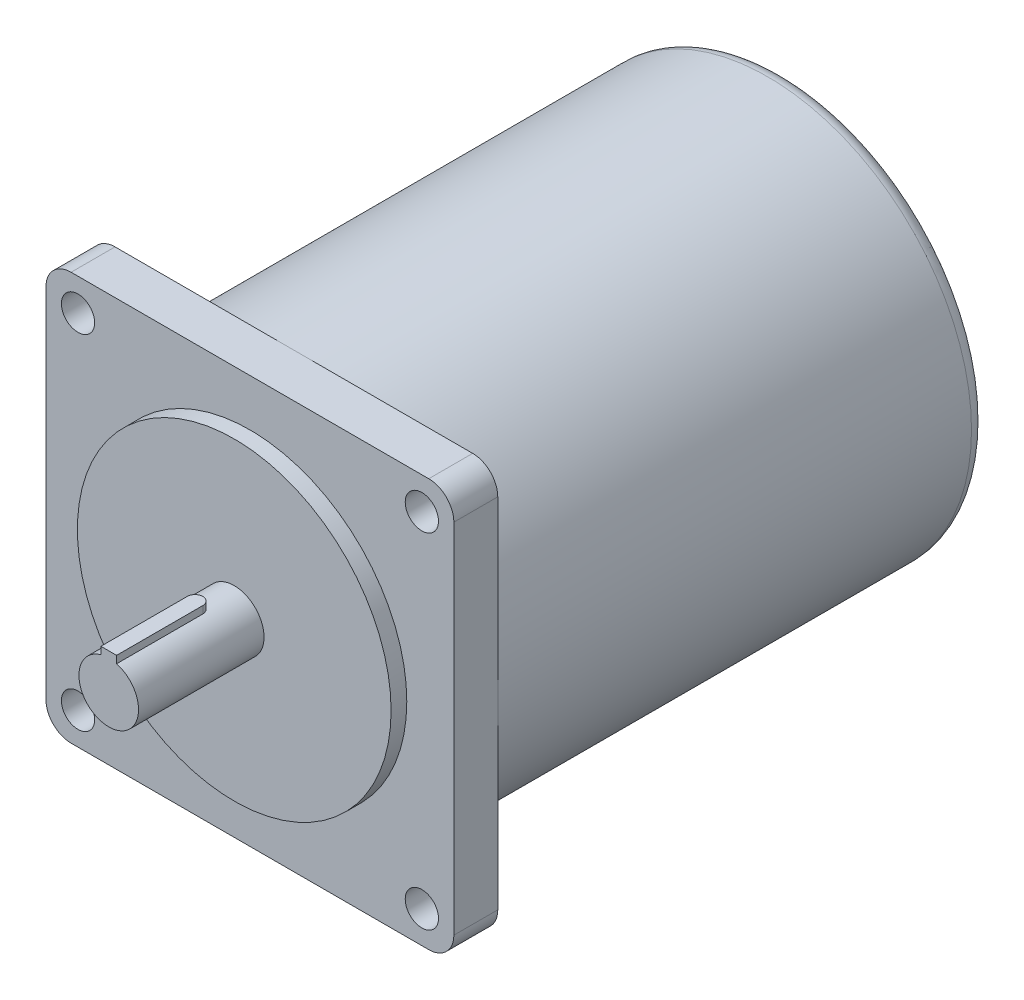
ISO-10303-21;
HEADER;
FILE_DESCRIPTION(('STEP AP214'),'2;1');
FILE_NAME('part.step','',(''),(''),'','','');
FILE_SCHEMA(('AUTOMOTIVE_DESIGN { 1 0 10303 214 1 1 1 1 }'));
ENDSEC;
DATA;
#1=APPLICATION_CONTEXT('core data for automotive mechanical design processes');
#2=APPLICATION_PROTOCOL_DEFINITION('international standard','automotive_design',2000,#1);
#3=PRODUCT_CONTEXT('',#1,'mechanical');
#4=PRODUCT('Part','Part','',(#3));
#5=PRODUCT_RELATED_PRODUCT_CATEGORY('part','',(#4));
#6=PRODUCT_DEFINITION_FORMATION('','',#4);
#7=PRODUCT_DEFINITION_CONTEXT('part definition',#1,'design');
#8=PRODUCT_DEFINITION('design','',#6,#7);
#9=PRODUCT_DEFINITION_SHAPE('','',#8);
#10=(LENGTH_UNIT() NAMED_UNIT(*) SI_UNIT(.MILLI.,.METRE.));
#11=(NAMED_UNIT(*) PLANE_ANGLE_UNIT() SI_UNIT($,.RADIAN.));
#12=(NAMED_UNIT(*) SI_UNIT($,.STERADIAN.) SOLID_ANGLE_UNIT());
#13=UNCERTAINTY_MEASURE_WITH_UNIT(LENGTH_MEASURE(1.E-05),#10,'distance_accuracy_value','');
#14=(GEOMETRIC_REPRESENTATION_CONTEXT(3) GLOBAL_UNCERTAINTY_ASSIGNED_CONTEXT((#13)) GLOBAL_UNIT_ASSIGNED_CONTEXT((#10,
#11,#12)) REPRESENTATION_CONTEXT('',''));
#15=CARTESIAN_POINT('',(0.,0.,0.));
#16=DIRECTION('',(0.,0.,1.));
#17=DIRECTION('',(1.,0.,0.));
#18=AXIS2_PLACEMENT_3D('',#15,#16,#17);
#19=CARTESIAN_POINT('',(57.,-57.,-19.));
#20=DIRECTION('',(0.,0.,1.));
#21=DIRECTION('',(1.,0.,0.));
#22=AXIS2_PLACEMENT_3D('',#19,#20,#21);
#23=PLANE('',#22);
#24=CARTESIAN_POINT('',(-54.8,54.8,-19.));
#25=DIRECTION('',(0.,0.,-1.));
#26=DIRECTION('',(-1.,0.,0.));
#27=AXIS2_PLACEMENT_3D('',#24,#25,#26);
#28=CIRCLE('',#27,5.3);
#29=CARTESIAN_POINT('',(-60.1,54.8,-19.));
#30=VERTEX_POINT('',#29);
#31=EDGE_CURVE('E184',#30,#30,#28,.T.);
#32=ORIENTED_EDGE('',*,*,#31,.F.);
#33=EDGE_LOOP('',(#32));
#34=FACE_BOUND('',#33,.T.);
#35=CARTESIAN_POINT('',(0.,0.,-19.));
#36=DIRECTION('',(0.,0.,-1.));
#37=DIRECTION('',(-1.,0.,0.));
#38=AXIS2_PLACEMENT_3D('',#35,#36,#37);
#39=CIRCLE('',#38,65.);
#40=CARTESIAN_POINT('',(-65.,0.,-19.));
#41=VERTEX_POINT('',#40);
#42=CARTESIAN_POINT('',(0.,65.,-19.));
#43=VERTEX_POINT('',#42);
#44=EDGE_CURVE('E160',#41,#43,#39,.T.);
#45=ORIENTED_EDGE('',*,*,#44,.F.);
#46=DIRECTION('',(0.,1.,0.));
#47=VECTOR('',#46,1.);
#48=CARTESIAN_POINT('',(-65.,56.9999999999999,-19.));
#49=LINE('',#48,#47);
#50=CARTESIAN_POINT('',(-65.,56.9999999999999,-19.));
#51=VERTEX_POINT('',#50);
#52=EDGE_CURVE('E149',#41,#51,#49,.T.);
#53=ORIENTED_EDGE('',*,*,#52,.T.);
#54=CARTESIAN_POINT('',(-57.,57.,-19.));
#55=DIRECTION('',(0.,0.,-1.));
#56=DIRECTION('',(1.,0.,0.));
#57=AXIS2_PLACEMENT_3D('',#54,#55,#56);
#58=CIRCLE('',#57,8.);
#59=CARTESIAN_POINT('',(-56.9999999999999,65.,-19.));
#60=VERTEX_POINT('',#59);
#61=EDGE_CURVE('E148',#51,#60,#58,.T.);
#62=ORIENTED_EDGE('',*,*,#61,.T.);
#63=DIRECTION('',(1.,0.,0.));
#64=VECTOR('',#63,1.);
#65=CARTESIAN_POINT('',(0.,65.,-19.));
#66=LINE('',#65,#64);
#67=EDGE_CURVE('E162',#60,#43,#66,.T.);
#68=ORIENTED_EDGE('',*,*,#67,.T.);
#69=EDGE_LOOP('',(#45,#53,#62,#68));
#70=FACE_BOUND('',#69,.T.);
#71=ADVANCED_FACE('F35',(#34,#70),#23,.F.);
#72=CARTESIAN_POINT('',(54.8,54.8,-19.));
#73=DIRECTION('',(0.,0.,-1.));
#74=DIRECTION('',(-1.,0.,0.));
#75=AXIS2_PLACEMENT_3D('',#72,#73,#74);
#76=CIRCLE('',#75,5.3);
#77=CARTESIAN_POINT('',(49.5,54.8,-19.));
#78=VERTEX_POINT('',#77);
#79=EDGE_CURVE('E190',#78,#78,#76,.T.);
#80=ORIENTED_EDGE('',*,*,#79,.F.);
#81=EDGE_LOOP('',(#80));
#82=FACE_BOUND('',#81,.T.);
#83=CARTESIAN_POINT('',(65.,0.,-19.));
#84=VERTEX_POINT('',#83);
#85=EDGE_CURVE('E58',#43,#84,#39,.T.);
#86=ORIENTED_EDGE('',*,*,#85,.F.);
#87=CARTESIAN_POINT('',(56.9999999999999,65.,-19.));
#88=VERTEX_POINT('',#87);
#89=EDGE_CURVE('E205',#43,#88,#66,.T.);
#90=ORIENTED_EDGE('',*,*,#89,.T.);
#91=CARTESIAN_POINT('',(57.,57.,-19.));
#92=DIRECTION('',(0.,0.,-1.));
#93=DIRECTION('',(1.,0.,0.));
#94=AXIS2_PLACEMENT_3D('',#91,#92,#93);
#95=CIRCLE('',#94,8.);
#96=CARTESIAN_POINT('',(65.,56.9999999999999,-19.));
#97=VERTEX_POINT('',#96);
#98=EDGE_CURVE('E207',#88,#97,#95,.T.);
#99=ORIENTED_EDGE('',*,*,#98,.T.);
#100=DIRECTION('',(0.,-1.,0.));
#101=VECTOR('',#100,1.);
#102=CARTESIAN_POINT('',(65.,-57.,-19.));
#103=LINE('',#102,#101);
#104=EDGE_CURVE('E210',#97,#84,#103,.T.);
#105=ORIENTED_EDGE('',*,*,#104,.T.);
#106=EDGE_LOOP('',(#86,#90,#99,#105));
#107=FACE_BOUND('',#106,.T.);
#108=ADVANCED_FACE('F311',(#82,#107),#23,.F.);
#109=CARTESIAN_POINT('',(54.8,-54.8,-19.));
#110=DIRECTION('',(0.,0.,-1.));
#111=DIRECTION('',(-1.,0.,0.));
#112=AXIS2_PLACEMENT_3D('',#109,#110,#111);
#113=CIRCLE('',#112,5.3);
#114=CARTESIAN_POINT('',(49.5,-54.8,-19.));
#115=VERTEX_POINT('',#114);
#116=EDGE_CURVE('E172',#115,#115,#113,.T.);
#117=ORIENTED_EDGE('',*,*,#116,.F.);
#118=EDGE_LOOP('',(#117));
#119=FACE_BOUND('',#118,.T.);
#120=CARTESIAN_POINT('',(0.,-65.,-19.));
#121=VERTEX_POINT('',#120);
#122=EDGE_CURVE('E50',#84,#121,#39,.T.);
#123=ORIENTED_EDGE('',*,*,#122,.F.);
#124=CARTESIAN_POINT('',(65.,-57.,-19.));
#125=VERTEX_POINT('',#124);
#126=EDGE_CURVE('E209',#84,#125,#103,.T.);
#127=ORIENTED_EDGE('',*,*,#126,.T.);
#128=CARTESIAN_POINT('',(57.,-57.,-19.));
#129=DIRECTION('',(0.,0.,-1.));
#130=DIRECTION('',(1.,0.,0.));
#131=AXIS2_PLACEMENT_3D('',#128,#129,#130);
#132=CIRCLE('',#131,8.);
#133=CARTESIAN_POINT('',(56.9999999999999,-65.,-19.));
#134=VERTEX_POINT('',#133);
#135=EDGE_CURVE('E196',#125,#134,#132,.T.);
#136=ORIENTED_EDGE('',*,*,#135,.T.);
#137=DIRECTION('',(-1.,0.,0.));
#138=VECTOR('',#137,1.);
#139=CARTESIAN_POINT('',(-57.,-65.,-19.));
#140=LINE('',#139,#138);
#141=EDGE_CURVE('E201',#134,#121,#140,.T.);
#142=ORIENTED_EDGE('',*,*,#141,.T.);
#143=EDGE_LOOP('',(#123,#127,#136,#142));
#144=FACE_BOUND('',#143,.T.);
#145=ADVANCED_FACE('F317',(#119,#144),#23,.F.);
#146=CARTESIAN_POINT('',(-54.8,-54.8,-19.));
#147=DIRECTION('',(0.,0.,-1.));
#148=DIRECTION('',(-1.,0.,0.));
#149=AXIS2_PLACEMENT_3D('',#146,#147,#148);
#150=CIRCLE('',#149,5.3);
#151=CARTESIAN_POINT('',(-60.1,-54.8,-19.));
#152=VERTEX_POINT('',#151);
#153=EDGE_CURVE('E178',#152,#152,#150,.T.);
#154=ORIENTED_EDGE('',*,*,#153,.F.);
#155=EDGE_LOOP('',(#154));
#156=FACE_BOUND('',#155,.T.);
#157=EDGE_CURVE('E141',#121,#41,#39,.T.);
#158=ORIENTED_EDGE('',*,*,#157,.F.);
#159=CARTESIAN_POINT('',(-57.,-65.,-19.));
#160=VERTEX_POINT('',#159);
#161=EDGE_CURVE('E199',#121,#160,#140,.T.);
#162=ORIENTED_EDGE('',*,*,#161,.T.);
#163=CARTESIAN_POINT('',(-57.,-57.,-19.));
#164=DIRECTION('',(0.,0.,-1.));
#165=DIRECTION('',(1.,0.,0.));
#166=AXIS2_PLACEMENT_3D('',#163,#164,#165);
#167=CIRCLE('',#166,8.);
#168=CARTESIAN_POINT('',(-65.,-56.9999999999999,-19.));
#169=VERTEX_POINT('',#168);
#170=EDGE_CURVE('E144',#160,#169,#167,.T.);
#171=ORIENTED_EDGE('',*,*,#170,.T.);
#172=EDGE_CURVE('E137',#169,#41,#49,.T.);
#173=ORIENTED_EDGE('',*,*,#172,.T.);
#174=EDGE_LOOP('',(#158,#162,#171,#173));
#175=FACE_BOUND('',#174,.T.);
#176=ADVANCED_FACE('F139',(#156,#175),#23,.F.);
#177=CARTESIAN_POINT('',(0.,0.,40.));
#178=DIRECTION('',(0.,0.,-1.));
#179=DIRECTION('',(-1.,0.,0.));
#180=AXIS2_PLACEMENT_3D('',#177,#178,#179);
#181=CYLINDRICAL_SURFACE('',#180,9.5);
#182=CARTESIAN_POINT('',(0.,0.,0.));
#183=DIRECTION('',(0.,0.,1.));
#184=DIRECTION('',(1.,0.,0.));
#185=AXIS2_PLACEMENT_3D('',#182,#183,#184);
#186=CIRCLE('',#185,9.5);
#187=CARTESIAN_POINT('',(9.5,0.,0.));
#188=VERTEX_POINT('',#187);
#189=EDGE_CURVE('E279',#188,#188,#186,.T.);
#190=ORIENTED_EDGE('',*,*,#189,.T.);
#191=EDGE_LOOP('',(#190));
#192=FACE_BOUND('',#191,.T.);
#193=DIRECTION('',(0.,0.,-1.));
#194=VECTOR('',#193,1.);
#195=CARTESIAN_POINT('',(-2.5,9.16515138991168,40.));
#196=LINE('',#195,#194);
#197=CARTESIAN_POINT('',(-2.5,9.16515138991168,12.5));
#198=VERTEX_POINT('',#197);
#199=CARTESIAN_POINT('',(-2.5,9.16515138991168,40.));
#200=VERTEX_POINT('',#199);
#201=EDGE_CURVE('E276',#198,#200,#196,.F.);
#202=ORIENTED_EDGE('',*,*,#201,.F.);
#203=CARTESIAN_POINT('',(0.,9.5,10.));
#204=CARTESIAN_POINT('',(-0.137884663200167,9.4999978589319,10.0000034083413));
#205=CARTESIAN_POINT('',(-0.275806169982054,9.49696845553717,10.0114455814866));
#206=CARTESIAN_POINT('',(-0.547680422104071,9.48517762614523,10.0568336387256));
#207=CARTESIAN_POINT('',(-0.681631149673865,9.47641333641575,10.0907907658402));
#208=CARTESIAN_POINT('',(-0.941599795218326,9.45412076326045,10.1800315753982));
#209=CARTESIAN_POINT('',(-1.06762755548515,9.44059853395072,10.2352881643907));
#210=CARTESIAN_POINT('',(-1.30862652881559,9.41022151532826,10.3654600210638));
#211=CARTESIAN_POINT('',(-1.42359708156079,9.39336652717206,10.4403764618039));
#212=CARTESIAN_POINT('',(-1.64181993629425,9.35771941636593,10.6095316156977));
#213=CARTESIAN_POINT('',(-1.74478634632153,9.33889486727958,10.7041323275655));
#214=CARTESIAN_POINT('',(-1.93359084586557,9.30164002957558,10.9091965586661));
#215=CARTESIAN_POINT('',(-2.01942679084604,9.28320979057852,11.0196620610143));
#216=CARTESIAN_POINT('',(-2.17291708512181,9.24849966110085,11.2555887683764));
#217=CARTESIAN_POINT('',(-2.24024449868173,9.23226073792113,11.3812692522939));
#218=CARTESIAN_POINT('',(-2.35270147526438,9.20424780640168,11.6426621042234));
#219=CARTESIAN_POINT('',(-2.39783501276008,9.19247299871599,11.7783726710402));
#220=CARTESIAN_POINT('',(-2.46363395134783,9.17505594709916,12.0528119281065));
#221=CARTESIAN_POINT('',(-2.48481677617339,9.16928424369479,12.1914081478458));
#222=CARTESIAN_POINT('',(-2.50372582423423,9.16413995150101,12.470298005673));
#223=CARTESIAN_POINT('',(-2.50145630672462,9.16476620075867,12.6105913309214));
#224=CARTESIAN_POINT('',(-2.47393631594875,9.1722310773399,12.8848702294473));
#225=CARTESIAN_POINT('',(-2.44930986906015,9.1789010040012,13.0189237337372));
#226=CARTESIAN_POINT('',(-2.37877367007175,9.19743185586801,13.2809260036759));
#227=CARTESIAN_POINT('',(-2.33286225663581,9.2092931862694,13.4088742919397));
#228=CARTESIAN_POINT('',(-2.22054589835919,9.23702010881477,13.6566707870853));
#229=CARTESIAN_POINT('',(-2.1539205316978,9.25292841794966,13.7764141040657));
#230=CARTESIAN_POINT('',(-2.00222137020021,9.28693362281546,14.0032413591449));
#231=CARTESIAN_POINT('',(-1.91714402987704,9.30503093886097,14.1103228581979));
#232=CARTESIAN_POINT('',(-1.72775627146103,9.3420790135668,14.3123544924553));
#233=CARTESIAN_POINT('',(-1.62292126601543,9.36103863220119,14.4068119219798));
#234=CARTESIAN_POINT('',(-1.3986680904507,9.39715951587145,14.5769046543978));
#235=CARTESIAN_POINT('',(-1.27924937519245,9.41432071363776,14.6525392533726));
#236=CARTESIAN_POINT('',(-1.02846858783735,9.44501219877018,14.7830484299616));
#237=CARTESIAN_POINT('',(-0.897059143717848,9.45852716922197,14.8378358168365));
#238=CARTESIAN_POINT('',(-0.626458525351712,9.48029259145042,14.924400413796));
#239=CARTESIAN_POINT('',(-0.487269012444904,9.48854416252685,14.9561825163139));
#240=CARTESIAN_POINT('',(-0.209265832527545,9.49868456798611,14.9950653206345));
#241=CARTESIAN_POINT('',(-0.070552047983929,9.50074610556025,15.0028361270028));
#242=CARTESIAN_POINT('',(0.206196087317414,9.49876969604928,14.9953236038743));
#243=CARTESIAN_POINT('',(0.344230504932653,9.49473236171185,14.9800425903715));
#244=CARTESIAN_POINT('',(0.613323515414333,9.48112321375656,14.9274104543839));
#245=CARTESIAN_POINT('',(0.744460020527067,9.47164474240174,14.8904313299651));
#246=CARTESIAN_POINT('',(0.998656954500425,9.44822690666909,14.7958831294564));
#247=CARTESIAN_POINT('',(1.12171651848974,9.43428706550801,14.7383118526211));
#248=CARTESIAN_POINT('',(1.35888360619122,9.40308612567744,14.6029586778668));
#249=CARTESIAN_POINT('',(1.47277384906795,9.38576639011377,14.5248099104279));
#250=CARTESIAN_POINT('',(1.68605972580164,9.34980860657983,14.3509829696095));
#251=CARTESIAN_POINT('',(1.78545256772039,9.33117030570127,14.2553014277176));
#252=CARTESIAN_POINT('',(1.96973268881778,9.29404354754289,14.0460009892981));
#253=CARTESIAN_POINT('',(2.05414772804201,9.27557319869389,13.9319623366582));
#254=CARTESIAN_POINT('',(2.20265077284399,9.24143699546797,13.690949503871));
#255=CARTESIAN_POINT('',(2.26673964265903,9.22577102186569,13.5639758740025));
#256=CARTESIAN_POINT('',(2.37228864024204,9.1991961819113,13.3013437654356));
#257=CARTESIAN_POINT('',(2.41388084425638,9.18825962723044,13.165741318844));
#258=CARTESIAN_POINT('',(2.47357685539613,9.17237100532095,12.8891317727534));
#259=CARTESIAN_POINT('',(2.49168647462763,9.16741745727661,12.7481260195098));
#260=CARTESIAN_POINT('',(2.5035754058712,9.16417710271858,12.4695408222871));
#261=CARTESIAN_POINT('',(2.49811278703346,9.16568256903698,12.3319956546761));
#262=CARTESIAN_POINT('',(2.46476570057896,9.17470557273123,12.0598619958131));
#263=CARTESIAN_POINT('',(2.43688178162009,9.18222296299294,11.9252734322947));
#264=CARTESIAN_POINT('',(2.35991776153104,9.20230081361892,11.6637995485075));
#265=CARTESIAN_POINT('',(2.31099432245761,9.21482395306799,11.5368650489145));
#266=CARTESIAN_POINT('',(2.19346205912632,9.2435040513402,11.2929108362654));
#267=CARTESIAN_POINT('',(2.12485022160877,9.25966156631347,11.1758926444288));
#268=CARTESIAN_POINT('',(1.96757430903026,9.29436941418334,10.9514645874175));
#269=CARTESIAN_POINT('',(1.87839103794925,9.31297513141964,10.8444270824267));
#270=CARTESIAN_POINT('',(1.68349652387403,9.35016921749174,10.6465905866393));
#271=CARTESIAN_POINT('',(1.57778128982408,9.36875758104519,10.5557955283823));
#272=CARTESIAN_POINT('',(1.35018708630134,9.40428175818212,10.3911797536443));
#273=CARTESIAN_POINT('',(1.22801920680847,9.42117547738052,10.3177486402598));
#274=CARTESIAN_POINT('',(0.972633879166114,9.45095016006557,10.1925825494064));
#275=CARTESIAN_POINT('',(0.839423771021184,9.46383376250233,10.1408332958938));
#276=CARTESIAN_POINT('',(0.588875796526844,9.48241870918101,10.0674519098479));
#277=CARTESIAN_POINT('',(0.472643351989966,9.4889642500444,10.0422152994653));
#278=CARTESIAN_POINT('',(0.237616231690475,9.49775561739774,10.0084886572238));
#279=CARTESIAN_POINT('',(0.118821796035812,9.50000184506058,9.99999706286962));
#280=CARTESIAN_POINT('',(0.,9.5,10.));
#281=B_SPLINE_CURVE_WITH_KNOTS('',3,(#203,#204,#205,#206,#207,#208,#209,#210,#211,#212,#213,
#214,#215,#216,#217,#218,#219,#220,#221,#222,#223,#224,#225,#226,#227,#228,#229,#230,#231,#232,
#233,#234,#235,#236,#237,#238,#239,#240,#241,#242,#243,#244,#245,#246,#247,#248,#249,#250,#251,
#252,#253,#254,#255,#256,#257,#258,#259,#260,#261,#262,#263,#264,#265,#266,#267,#268,#269,#270,
#271,#272,#273,#274,#275,#276,#277,#278,#279,#280),.UNSPECIFIED.,.T.,.F.,(4,2,2,2,2,2,2,2,2,2,2,
2,2,2,2,2,2,2,2,2,2,2,2,2,2,2,2,2,2,2,2,2,2,2,2,2,2,2,4),(0.,0.41321830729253,0.826643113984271,
1.23954376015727,1.65246904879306,2.07379267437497,2.49516901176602,2.92356960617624,
3.35189345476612,3.77077570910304,4.18958189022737,4.59704611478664,5.00454214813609,
5.41653210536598,5.82860129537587,6.25374475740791,6.67890411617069,7.10582259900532,
7.53265026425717,7.9474532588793,8.36221458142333,8.77006471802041,9.17795845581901,
9.59368485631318,10.0094912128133,10.4366941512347,10.8638789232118,11.2885277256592,
11.7130714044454,12.1240655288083,12.5350495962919,12.9430250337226,13.3510629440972,
13.7708169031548,14.1906723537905,14.6192052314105,15.0474555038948,15.4035786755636,
15.7596686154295),.UNSPECIFIED.);
#282=CARTESIAN_POINT('',(2.5,9.16515138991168,12.5));
#283=VERTEX_POINT('',#282);
#284=EDGE_CURVE('E167',#283,#198,#281,.T.);
#285=ORIENTED_EDGE('',*,*,#284,.F.);
#286=DIRECTION('',(0.,0.,-1.));
#287=VECTOR('',#286,1.);
#288=CARTESIAN_POINT('',(2.5,9.16515138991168,40.));
#289=LINE('',#288,#287);
#290=CARTESIAN_POINT('',(2.5,9.16515138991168,40.));
#291=VERTEX_POINT('',#290);
#292=EDGE_CURVE('E273',#291,#283,#289,.T.);
#293=ORIENTED_EDGE('',*,*,#292,.F.);
#294=CARTESIAN_POINT('',(0.,0.,40.));
#295=DIRECTION('',(0.,0.,1.));
#296=DIRECTION('',(1.,0.,0.));
#297=AXIS2_PLACEMENT_3D('',#294,#295,#296);
#298=CIRCLE('',#297,9.5);
#299=EDGE_CURVE('E280',#200,#291,#298,.T.);
#300=ORIENTED_EDGE('',*,*,#299,.F.);
#301=EDGE_LOOP('',(#202,#285,#293,#300));
#302=FACE_BOUND('',#301,.T.);
#303=ADVANCED_FACE('F290',(#192,#302),#181,.T.);
#304=CARTESIAN_POINT('',(0.,0.,0.));
#305=DIRECTION('',(0.,0.,1.));
#306=DIRECTION('',(1.,0.,0.));
#307=AXIS2_PLACEMENT_3D('',#304,#305,#306);
#308=PLANE('',#307);
#309=CARTESIAN_POINT('',(0.,0.,0.));
#310=DIRECTION('',(0.,0.,1.));
#311=DIRECTION('',(1.,0.,0.));
#312=AXIS2_PLACEMENT_3D('',#309,#310,#311);
#313=CIRCLE('',#312,50.);
#314=CARTESIAN_POINT('',(50.,0.,0.));
#315=VERTEX_POINT('',#314);
#316=EDGE_CURVE('E169',#315,#315,#313,.T.);
#317=ORIENTED_EDGE('',*,*,#316,.T.);
#318=EDGE_LOOP('',(#317));
#319=FACE_BOUND('',#318,.T.);
#320=ORIENTED_EDGE('',*,*,#189,.F.);
#321=EDGE_LOOP('',(#320));
#322=FACE_BOUND('',#321,.T.);
#323=ADVANCED_FACE('F308',(#319,#322),#308,.T.);
#324=CARTESIAN_POINT('',(0.,0.,-5.));
#325=DIRECTION('',(0.,0.,1.));
#326=DIRECTION('',(1.,0.,0.));
#327=AXIS2_PLACEMENT_3D('',#324,#325,#326);
#328=CYLINDRICAL_SURFACE('',#327,50.);
#329=CARTESIAN_POINT('',(0.,0.,-5.));
#330=DIRECTION('',(0.,0.,1.));
#331=DIRECTION('',(1.,0.,0.));
#332=AXIS2_PLACEMENT_3D('',#329,#330,#331);
#333=CIRCLE('',#332,50.);
#334=CARTESIAN_POINT('',(50.,0.,-5.));
#335=VERTEX_POINT('',#334);
#336=EDGE_CURVE('E249',#335,#335,#333,.F.);
#337=ORIENTED_EDGE('',*,*,#336,.F.);
#338=EDGE_LOOP('',(#337));
#339=FACE_BOUND('',#338,.T.);
#340=ORIENTED_EDGE('',*,*,#316,.F.);
#341=EDGE_LOOP('',(#340));
#342=FACE_BOUND('',#341,.T.);
#343=ADVANCED_FACE('F303',(#339,#342),#328,.T.);
#344=CARTESIAN_POINT('',(0.,0.,40.));
#345=DIRECTION('',(0.,0.,1.));
#346=DIRECTION('',(1.,0.,0.));
#347=AXIS2_PLACEMENT_3D('',#344,#345,#346);
#348=PLANE('',#347);
#349=ORIENTED_EDGE('',*,*,#299,.T.);
#350=DIRECTION('',(0.,-1.,0.));
#351=VECTOR('',#350,1.);
#352=CARTESIAN_POINT('',(2.5,11.5,40.));
#353=LINE('',#352,#351);
#354=CARTESIAN_POINT('',(2.5,11.5,40.));
#355=VERTEX_POINT('',#354);
#356=EDGE_CURVE('E264',#355,#291,#353,.T.);
#357=ORIENTED_EDGE('',*,*,#356,.F.);
#358=DIRECTION('',(1.,0.,0.));
#359=VECTOR('',#358,1.);
#360=CARTESIAN_POINT('',(-2.5,11.5,40.));
#361=LINE('',#360,#359);
#362=CARTESIAN_POINT('',(-2.5,11.5,40.));
#363=VERTEX_POINT('',#362);
#364=EDGE_CURVE('E257',#363,#355,#361,.T.);
#365=ORIENTED_EDGE('',*,*,#364,.F.);
#366=DIRECTION('',(0.,-1.,0.));
#367=VECTOR('',#366,1.);
#368=CARTESIAN_POINT('',(-2.5,11.5,40.));
#369=LINE('',#368,#367);
#370=EDGE_CURVE('E267',#363,#200,#369,.T.);
#371=ORIENTED_EDGE('',*,*,#370,.T.);
#372=EDGE_LOOP('',(#349,#357,#365,#371));
#373=FACE_BOUND('',#372,.T.);
#374=ADVANCED_FACE('F299',(#373),#348,.T.);
#375=CARTESIAN_POINT('',(0.,11.5,12.5));
#376=DIRECTION('',(0.,-1.,0.));
#377=DIRECTION('',(0.,0.,-1.));
#378=AXIS2_PLACEMENT_3D('',#375,#376,#377);
#379=CYLINDRICAL_SURFACE('',#378,2.5);
#380=DIRECTION('',(0.,-1.,0.));
#381=VECTOR('',#380,1.);
#382=CARTESIAN_POINT('',(2.5,11.5,12.5));
#383=LINE('',#382,#381);
#384=CARTESIAN_POINT('',(2.5,11.5,12.5));
#385=VERTEX_POINT('',#384);
#386=EDGE_CURVE('E261',#385,#283,#383,.T.);
#387=ORIENTED_EDGE('',*,*,#386,.T.);
#388=ORIENTED_EDGE('',*,*,#284,.T.);
#389=DIRECTION('',(0.,-1.,0.));
#390=VECTOR('',#389,1.);
#391=CARTESIAN_POINT('',(-2.5,11.5,12.5));
#392=LINE('',#391,#390);
#393=CARTESIAN_POINT('',(-2.5,11.5,12.5));
#394=VERTEX_POINT('',#393);
#395=EDGE_CURVE('E270',#394,#198,#392,.T.);
#396=ORIENTED_EDGE('',*,*,#395,.F.);
#397=CARTESIAN_POINT('',(0.,11.5,12.5));
#398=DIRECTION('',(0.,1.,0.));
#399=DIRECTION('',(0.,0.,1.));
#400=AXIS2_PLACEMENT_3D('',#397,#398,#399);
#401=CIRCLE('',#400,2.5);
#402=EDGE_CURVE('E252',#385,#394,#401,.T.);
#403=ORIENTED_EDGE('',*,*,#402,.F.);
#404=EDGE_LOOP('',(#387,#388,#396,#403));
#405=FACE_BOUND('',#404,.T.);
#406=ADVANCED_FACE('F294',(#405),#379,.T.);
#407=CARTESIAN_POINT('',(-2.5,11.5,12.5));
#408=DIRECTION('',(1.,0.,0.));
#409=DIRECTION('',(0.,0.,-1.));
#410=AXIS2_PLACEMENT_3D('',#407,#408,#409);
#411=PLANE('',#410);
#412=ORIENTED_EDGE('',*,*,#395,.T.);
#413=ORIENTED_EDGE('',*,*,#201,.T.);
#414=ORIENTED_EDGE('',*,*,#370,.F.);
#415=DIRECTION('',(0.,0.,1.));
#416=VECTOR('',#415,1.);
#417=CARTESIAN_POINT('',(-2.5,11.5,12.5));
#418=LINE('',#417,#416);
#419=EDGE_CURVE('E255',#394,#363,#418,.T.);
#420=ORIENTED_EDGE('',*,*,#419,.F.);
#421=EDGE_LOOP('',(#412,#413,#414,#420));
#422=FACE_BOUND('',#421,.T.);
#423=ADVANCED_FACE('F298',(#422),#411,.F.);
#424=CARTESIAN_POINT('',(2.5,11.5,40.));
#425=DIRECTION('',(-1.,0.,0.));
#426=DIRECTION('',(0.,0.,1.));
#427=AXIS2_PLACEMENT_3D('',#424,#425,#426);
#428=PLANE('',#427);
#429=ORIENTED_EDGE('',*,*,#356,.T.);
#430=ORIENTED_EDGE('',*,*,#292,.T.);
#431=ORIENTED_EDGE('',*,*,#386,.F.);
#432=DIRECTION('',(0.,0.,-1.));
#433=VECTOR('',#432,1.);
#434=CARTESIAN_POINT('',(2.5,11.5,40.));
#435=LINE('',#434,#433);
#436=EDGE_CURVE('E259',#355,#385,#435,.T.);
#437=ORIENTED_EDGE('',*,*,#436,.F.);
#438=EDGE_LOOP('',(#429,#430,#431,#437));
#439=FACE_BOUND('',#438,.T.);
#440=ADVANCED_FACE('F408',(#439),#428,.F.);
#441=CARTESIAN_POINT('',(0.,11.5,12.5));
#442=DIRECTION('',(0.,1.,0.));
#443=DIRECTION('',(0.,0.,1.));
#444=AXIS2_PLACEMENT_3D('',#441,#442,#443);
#445=PLANE('',#444);
#446=ORIENTED_EDGE('',*,*,#402,.T.);
#447=ORIENTED_EDGE('',*,*,#419,.T.);
#448=ORIENTED_EDGE('',*,*,#364,.T.);
#449=ORIENTED_EDGE('',*,*,#436,.T.);
#450=EDGE_LOOP('',(#446,#447,#448,#449));
#451=FACE_BOUND('',#450,.T.);
#452=ADVANCED_FACE('F344',(#451),#445,.T.);
#453=CARTESIAN_POINT('',(57.,-57.,-5.));
#454=DIRECTION('',(0.,0.,1.));
#455=DIRECTION('',(1.,0.,0.));
#456=AXIS2_PLACEMENT_3D('',#453,#454,#455);
#457=PLANE('',#456);
#458=ORIENTED_EDGE('',*,*,#336,.T.);
#459=EDGE_LOOP('',(#458));
#460=FACE_BOUND('',#459,.T.);
#461=CARTESIAN_POINT('',(-54.8,-54.8,-5.));
#462=DIRECTION('',(0.,0.,-1.));
#463=DIRECTION('',(-1.,0.,0.));
#464=AXIS2_PLACEMENT_3D('',#461,#462,#463);
#465=CIRCLE('',#464,5.3);
#466=CARTESIAN_POINT('',(-60.1,-54.8,-5.));
#467=VERTEX_POINT('',#466);
#468=EDGE_CURVE('E175',#467,#467,#465,.T.);
#469=ORIENTED_EDGE('',*,*,#468,.T.);
#470=EDGE_LOOP('',(#469));
#471=FACE_BOUND('',#470,.T.);
#472=CARTESIAN_POINT('',(54.8,54.8,-5.));
#473=DIRECTION('',(0.,0.,-1.));
#474=DIRECTION('',(-1.,0.,0.));
#475=AXIS2_PLACEMENT_3D('',#472,#473,#474);
#476=CIRCLE('',#475,5.3);
#477=CARTESIAN_POINT('',(49.5,54.8,-5.));
#478=VERTEX_POINT('',#477);
#479=EDGE_CURVE('E187',#478,#478,#476,.T.);
#480=ORIENTED_EDGE('',*,*,#479,.T.);
#481=EDGE_LOOP('',(#480));
#482=FACE_BOUND('',#481,.T.);
#483=CARTESIAN_POINT('',(57.,-57.,-5.));
#484=DIRECTION('',(0.,0.,-1.));
#485=DIRECTION('',(1.,0.,0.));
#486=AXIS2_PLACEMENT_3D('',#483,#484,#485);
#487=CIRCLE('',#486,8.);
#488=CARTESIAN_POINT('',(65.,-57.,-5.));
#489=VERTEX_POINT('',#488);
#490=CARTESIAN_POINT('',(56.9999999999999,-65.,-5.));
#491=VERTEX_POINT('',#490);
#492=EDGE_CURVE('E193',#489,#491,#487,.T.);
#493=ORIENTED_EDGE('',*,*,#492,.F.);
#494=DIRECTION('',(0.,-1.,0.));
#495=VECTOR('',#494,1.);
#496=CARTESIAN_POINT('',(65.,-57.,-5.));
#497=LINE('',#496,#495);
#498=CARTESIAN_POINT('',(65.,56.9999999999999,-5.));
#499=VERTEX_POINT('',#498);
#500=EDGE_CURVE('E200',#499,#489,#497,.T.);
#501=ORIENTED_EDGE('',*,*,#500,.F.);
#502=CARTESIAN_POINT('',(57.,57.,-5.));
#503=DIRECTION('',(0.,0.,-1.));
#504=DIRECTION('',(1.,0.,0.));
#505=AXIS2_PLACEMENT_3D('',#502,#503,#504);
#506=CIRCLE('',#505,8.);
#507=CARTESIAN_POINT('',(56.9999999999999,65.,-5.));
#508=VERTEX_POINT('',#507);
#509=EDGE_CURVE('E226',#508,#499,#506,.T.);
#510=ORIENTED_EDGE('',*,*,#509,.F.);
#511=DIRECTION('',(1.,0.,0.));
#512=VECTOR('',#511,1.);
#513=CARTESIAN_POINT('',(56.9999999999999,65.,-5.));
#514=LINE('',#513,#512);
#515=CARTESIAN_POINT('',(-56.9999999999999,65.,-5.));
#516=VERTEX_POINT('',#515);
#517=EDGE_CURVE('E224',#516,#508,#514,.T.);
#518=ORIENTED_EDGE('',*,*,#517,.F.);
#519=CARTESIAN_POINT('',(-57.,57.,-5.));
#520=DIRECTION('',(0.,0.,-1.));
#521=DIRECTION('',(1.,0.,0.));
#522=AXIS2_PLACEMENT_3D('',#519,#520,#521);
#523=CIRCLE('',#522,8.);
#524=CARTESIAN_POINT('',(-65.,56.9999999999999,-5.));
#525=VERTEX_POINT('',#524);
#526=EDGE_CURVE('E221',#525,#516,#523,.T.);
#527=ORIENTED_EDGE('',*,*,#526,.F.);
#528=DIRECTION('',(0.,1.,0.));
#529=VECTOR('',#528,1.);
#530=CARTESIAN_POINT('',(-65.,56.9999999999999,-5.));
#531=LINE('',#530,#529);
#532=CARTESIAN_POINT('',(-65.,-56.9999999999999,-5.));
#533=VERTEX_POINT('',#532);
#534=EDGE_CURVE('E219',#533,#525,#531,.T.);
#535=ORIENTED_EDGE('',*,*,#534,.F.);
#536=CARTESIAN_POINT('',(-57.,-57.,-5.));
#537=DIRECTION('',(0.,0.,-1.));
#538=DIRECTION('',(1.,0.,0.));
#539=AXIS2_PLACEMENT_3D('',#536,#537,#538);
#540=CIRCLE('',#539,8.);
#541=CARTESIAN_POINT('',(-57.,-65.,-5.));
#542=VERTEX_POINT('',#541);
#543=EDGE_CURVE('E217',#542,#533,#540,.T.);
#544=ORIENTED_EDGE('',*,*,#543,.F.);
#545=DIRECTION('',(-1.,0.,0.));
#546=VECTOR('',#545,1.);
#547=CARTESIAN_POINT('',(-57.,-65.,-5.));
#548=LINE('',#547,#546);
#549=EDGE_CURVE('E215',#491,#542,#548,.T.);
#550=ORIENTED_EDGE('',*,*,#549,.F.);
#551=EDGE_LOOP('',(#493,#501,#510,#518,#527,#535,#544,#550));
#552=FACE_BOUND('',#551,.T.);
#553=CARTESIAN_POINT('',(-54.8,54.8,-5.));
#554=DIRECTION('',(0.,0.,-1.));
#555=DIRECTION('',(-1.,0.,0.));
#556=AXIS2_PLACEMENT_3D('',#553,#554,#555);
#557=CIRCLE('',#556,5.3);
#558=CARTESIAN_POINT('',(-60.1,54.8,-5.));
#559=VERTEX_POINT('',#558);
#560=EDGE_CURVE('E181',#559,#559,#557,.T.);
#561=ORIENTED_EDGE('',*,*,#560,.T.);
#562=EDGE_LOOP('',(#561));
#563=FACE_BOUND('',#562,.T.);
#564=CARTESIAN_POINT('',(54.8,-54.8,-5.));
#565=DIRECTION('',(0.,0.,-1.));
#566=DIRECTION('',(-1.,0.,0.));
#567=AXIS2_PLACEMENT_3D('',#564,#565,#566);
#568=CIRCLE('',#567,5.3);
#569=CARTESIAN_POINT('',(49.5,-54.8,-5.));
#570=VERTEX_POINT('',#569);
#571=EDGE_CURVE('E164',#570,#570,#568,.T.);
#572=ORIENTED_EDGE('',*,*,#571,.T.);
#573=EDGE_LOOP('',(#572));
#574=FACE_BOUND('',#573,.T.);
#575=ADVANCED_FACE('F340',(#460,#471,#482,#552,#563,#574),#457,.T.);
#576=CARTESIAN_POINT('',(57.,-57.,-19.));
#577=DIRECTION('',(0.,0.,1.));
#578=DIRECTION('',(1.,0.,0.));
#579=AXIS2_PLACEMENT_3D('',#576,#577,#578);
#580=CYLINDRICAL_SURFACE('',#579,8.);
#581=ORIENTED_EDGE('',*,*,#492,.T.);
#582=DIRECTION('',(0.,0.,1.));
#583=VECTOR('',#582,1.);
#584=CARTESIAN_POINT('',(56.9999999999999,-65.,-19.));
#585=LINE('',#584,#583);
#586=EDGE_CURVE('E246',#134,#491,#585,.T.);
#587=ORIENTED_EDGE('',*,*,#586,.F.);
#588=ORIENTED_EDGE('',*,*,#135,.F.);
#589=DIRECTION('',(0.,0.,1.));
#590=VECTOR('',#589,1.);
#591=CARTESIAN_POINT('',(65.,-57.,-19.));
#592=LINE('',#591,#590);
#593=EDGE_CURVE('E212',#125,#489,#592,.T.);
#594=ORIENTED_EDGE('',*,*,#593,.T.);
#595=EDGE_LOOP('',(#581,#587,#588,#594));
#596=FACE_BOUND('',#595,.T.);
#597=ADVANCED_FACE('F343',(#596),#580,.T.);
#598=CARTESIAN_POINT('',(-57.,-65.,-19.));
#599=DIRECTION('',(0.,1.,0.));
#600=DIRECTION('',(-1.,0.,0.));
#601=AXIS2_PLACEMENT_3D('',#598,#599,#600);
#602=PLANE('',#601);
#603=ORIENTED_EDGE('',*,*,#549,.T.);
#604=DIRECTION('',(0.,0.,1.));
#605=VECTOR('',#604,1.);
#606=CARTESIAN_POINT('',(-57.,-65.,-19.));
#607=LINE('',#606,#605);
#608=EDGE_CURVE('E243',#160,#542,#607,.T.);
#609=ORIENTED_EDGE('',*,*,#608,.F.);
#610=ORIENTED_EDGE('',*,*,#161,.F.);
#611=ORIENTED_EDGE('',*,*,#141,.F.);
#612=ORIENTED_EDGE('',*,*,#586,.T.);
#613=EDGE_LOOP('',(#603,#609,#610,#611,#612));
#614=FACE_BOUND('',#613,.T.);
#615=ADVANCED_FACE('F399',(#614),#602,.F.);
#616=CARTESIAN_POINT('',(-57.,-57.,-19.));
#617=DIRECTION('',(0.,0.,1.));
#618=DIRECTION('',(1.,0.,0.));
#619=AXIS2_PLACEMENT_3D('',#616,#617,#618);
#620=CYLINDRICAL_SURFACE('',#619,8.);
#621=ORIENTED_EDGE('',*,*,#543,.T.);
#622=DIRECTION('',(0.,0.,1.));
#623=VECTOR('',#622,1.);
#624=CARTESIAN_POINT('',(-65.,-56.9999999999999,-19.));
#625=LINE('',#624,#623);
#626=EDGE_CURVE('E241',#169,#533,#625,.T.);
#627=ORIENTED_EDGE('',*,*,#626,.F.);
#628=ORIENTED_EDGE('',*,*,#170,.F.);
#629=ORIENTED_EDGE('',*,*,#608,.T.);
#630=EDGE_LOOP('',(#621,#627,#628,#629));
#631=FACE_BOUND('',#630,.T.);
#632=ADVANCED_FACE('F396',(#631),#620,.T.);
#633=CARTESIAN_POINT('',(-65.,56.9999999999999,-19.));
#634=DIRECTION('',(1.,0.,0.));
#635=DIRECTION('',(0.,1.,0.));
#636=AXIS2_PLACEMENT_3D('',#633,#634,#635);
#637=PLANE('',#636);
#638=ORIENTED_EDGE('',*,*,#534,.T.);
#639=DIRECTION('',(0.,0.,1.));
#640=VECTOR('',#639,1.);
#641=CARTESIAN_POINT('',(-65.,56.9999999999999,-19.));
#642=LINE('',#641,#640);
#643=EDGE_CURVE('E155',#51,#525,#642,.T.);
#644=ORIENTED_EDGE('',*,*,#643,.F.);
#645=ORIENTED_EDGE('',*,*,#52,.F.);
#646=ORIENTED_EDGE('',*,*,#172,.F.);
#647=ORIENTED_EDGE('',*,*,#626,.T.);
#648=EDGE_LOOP('',(#638,#644,#645,#646,#647));
#649=FACE_BOUND('',#648,.T.);
#650=ADVANCED_FACE('F153',(#649),#637,.F.);
#651=CARTESIAN_POINT('',(-57.,57.,-19.));
#652=DIRECTION('',(0.,0.,1.));
#653=DIRECTION('',(1.,0.,0.));
#654=AXIS2_PLACEMENT_3D('',#651,#652,#653);
#655=CYLINDRICAL_SURFACE('',#654,8.);
#656=ORIENTED_EDGE('',*,*,#526,.T.);
#657=DIRECTION('',(0.,0.,1.));
#658=VECTOR('',#657,1.);
#659=CARTESIAN_POINT('',(-56.9999999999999,65.,-19.));
#660=LINE('',#659,#658);
#661=EDGE_CURVE('E237',#60,#516,#660,.T.);
#662=ORIENTED_EDGE('',*,*,#661,.F.);
#663=ORIENTED_EDGE('',*,*,#61,.F.);
#664=ORIENTED_EDGE('',*,*,#643,.T.);
#665=EDGE_LOOP('',(#656,#662,#663,#664));
#666=FACE_BOUND('',#665,.T.);
#667=ADVANCED_FACE('F389',(#666),#655,.T.);
#668=CARTESIAN_POINT('',(56.9999999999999,65.,-19.));
#669=DIRECTION('',(0.,-1.,0.));
#670=DIRECTION('',(1.,0.,0.));
#671=AXIS2_PLACEMENT_3D('',#668,#669,#670);
#672=PLANE('',#671);
#673=ORIENTED_EDGE('',*,*,#517,.T.);
#674=DIRECTION('',(0.,0.,1.));
#675=VECTOR('',#674,1.);
#676=CARTESIAN_POINT('',(56.9999999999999,65.,-19.));
#677=LINE('',#676,#675);
#678=EDGE_CURVE('E234',#88,#508,#677,.T.);
#679=ORIENTED_EDGE('',*,*,#678,.F.);
#680=ORIENTED_EDGE('',*,*,#89,.F.);
#681=ORIENTED_EDGE('',*,*,#67,.F.);
#682=ORIENTED_EDGE('',*,*,#661,.T.);
#683=EDGE_LOOP('',(#673,#679,#680,#681,#682));
#684=FACE_BOUND('',#683,.T.);
#685=ADVANCED_FACE('F383',(#684),#672,.F.);
#686=CARTESIAN_POINT('',(57.,57.,-19.));
#687=DIRECTION('',(0.,0.,1.));
#688=DIRECTION('',(1.,0.,0.));
#689=AXIS2_PLACEMENT_3D('',#686,#687,#688);
#690=CYLINDRICAL_SURFACE('',#689,8.);
#691=ORIENTED_EDGE('',*,*,#509,.T.);
#692=DIRECTION('',(0.,0.,1.));
#693=VECTOR('',#692,1.);
#694=CARTESIAN_POINT('',(65.,56.9999999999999,-19.));
#695=LINE('',#694,#693);
#696=EDGE_CURVE('E231',#97,#499,#695,.T.);
#697=ORIENTED_EDGE('',*,*,#696,.F.);
#698=ORIENTED_EDGE('',*,*,#98,.F.);
#699=ORIENTED_EDGE('',*,*,#678,.T.);
#700=EDGE_LOOP('',(#691,#697,#698,#699));
#701=FACE_BOUND('',#700,.T.);
#702=ADVANCED_FACE('F375',(#701),#690,.T.);
#703=CARTESIAN_POINT('',(65.,-57.,-19.));
#704=DIRECTION('',(-1.,0.,0.));
#705=DIRECTION('',(0.,0.,1.));
#706=AXIS2_PLACEMENT_3D('',#703,#704,#705);
#707=PLANE('',#706);
#708=ORIENTED_EDGE('',*,*,#500,.T.);
#709=ORIENTED_EDGE('',*,*,#593,.F.);
#710=ORIENTED_EDGE('',*,*,#126,.F.);
#711=ORIENTED_EDGE('',*,*,#104,.F.);
#712=ORIENTED_EDGE('',*,*,#696,.T.);
#713=EDGE_LOOP('',(#708,#709,#710,#711,#712));
#714=FACE_BOUND('',#713,.T.);
#715=ADVANCED_FACE('F370',(#714),#707,.F.);
#716=CARTESIAN_POINT('',(54.8,54.8,-19.));
#717=DIRECTION('',(0.,0.,1.));
#718=DIRECTION('',(1.,0.,0.));
#719=AXIS2_PLACEMENT_3D('',#716,#717,#718);
#720=CYLINDRICAL_SURFACE('',#719,5.3);
#721=ORIENTED_EDGE('',*,*,#79,.T.);
#722=EDGE_LOOP('',(#721));
#723=FACE_BOUND('',#722,.T.);
#724=ORIENTED_EDGE('',*,*,#479,.F.);
#725=EDGE_LOOP('',(#724));
#726=FACE_BOUND('',#725,.T.);
#727=ADVANCED_FACE('F367',(#723,#726),#720,.F.);
#728=CARTESIAN_POINT('',(-54.8,54.8,-19.));
#729=DIRECTION('',(0.,0.,1.));
#730=DIRECTION('',(1.,0.,0.));
#731=AXIS2_PLACEMENT_3D('',#728,#729,#730);
#732=CYLINDRICAL_SURFACE('',#731,5.3);
#733=ORIENTED_EDGE('',*,*,#31,.T.);
#734=EDGE_LOOP('',(#733));
#735=FACE_BOUND('',#734,.T.);
#736=ORIENTED_EDGE('',*,*,#560,.F.);
#737=EDGE_LOOP('',(#736));
#738=FACE_BOUND('',#737,.T.);
#739=ADVANCED_FACE('F336',(#735,#738),#732,.F.);
#740=CARTESIAN_POINT('',(-54.8,-54.8,-19.));
#741=DIRECTION('',(0.,0.,1.));
#742=DIRECTION('',(1.,0.,0.));
#743=AXIS2_PLACEMENT_3D('',#740,#741,#742);
#744=CYLINDRICAL_SURFACE('',#743,5.3);
#745=ORIENTED_EDGE('',*,*,#153,.T.);
#746=EDGE_LOOP('',(#745));
#747=FACE_BOUND('',#746,.T.);
#748=ORIENTED_EDGE('',*,*,#468,.F.);
#749=EDGE_LOOP('',(#748));
#750=FACE_BOUND('',#749,.T.);
#751=ADVANCED_FACE('F332',(#747,#750),#744,.F.);
#752=CARTESIAN_POINT('',(54.8,-54.8,-19.));
#753=DIRECTION('',(0.,0.,1.));
#754=DIRECTION('',(1.,0.,0.));
#755=AXIS2_PLACEMENT_3D('',#752,#753,#754);
#756=CYLINDRICAL_SURFACE('',#755,5.3);
#757=ORIENTED_EDGE('',*,*,#116,.T.);
#758=EDGE_LOOP('',(#757));
#759=FACE_BOUND('',#758,.T.);
#760=ORIENTED_EDGE('',*,*,#571,.F.);
#761=EDGE_LOOP('',(#760));
#762=FACE_BOUND('',#761,.T.);
#763=ADVANCED_FACE('F335',(#759,#762),#756,.F.);
#764=CARTESIAN_POINT('',(0.,0.,-175.));
#765=DIRECTION('',(0.,0.,1.));
#766=DIRECTION('',(1.,0.,0.));
#767=AXIS2_PLACEMENT_3D('',#764,#765,#766);
#768=CYLINDRICAL_SURFACE('',#767,65.);
#769=CARTESIAN_POINT('',(0.,0.,-170.));
#770=DIRECTION('',(0.,0.,-1.));
#771=DIRECTION('',(-1.,0.,0.));
#772=AXIS2_PLACEMENT_3D('',#769,#770,#771);
#773=CIRCLE('',#772,65.);
#774=CARTESIAN_POINT('',(-65.,0.,-170.));
#775=VERTEX_POINT('',#774);
#776=EDGE_CURVE('E11',#775,#775,#773,.F.);
#777=ORIENTED_EDGE('',*,*,#776,.T.);
#778=EDGE_LOOP('',(#777));
#779=FACE_BOUND('',#778,.T.);
#780=ORIENTED_EDGE('',*,*,#44,.T.);
#781=ORIENTED_EDGE('',*,*,#85,.T.);
#782=ORIENTED_EDGE('',*,*,#122,.T.);
#783=ORIENTED_EDGE('',*,*,#157,.T.);
#784=EDGE_LOOP('',(#780,#781,#782,#783));
#785=FACE_BOUND('',#784,.T.);
#786=ADVANCED_FACE('F166',(#779,#785),#768,.T.);
#787=CARTESIAN_POINT('',(0.,0.,-175.));
#788=DIRECTION('',(0.,0.,-1.));
#789=DIRECTION('',(-1.,0.,0.));
#790=AXIS2_PLACEMENT_3D('',#787,#788,#789);
#791=PLANE('',#790);
#792=CARTESIAN_POINT('',(0.,0.,-175.));
#793=DIRECTION('',(0.,0.,-1.));
#794=DIRECTION('',(-1.,0.,0.));
#795=AXIS2_PLACEMENT_3D('',#792,#793,#794);
#796=CIRCLE('',#795,60.);
#797=CARTESIAN_POINT('',(-60.,0.,-175.));
#798=VERTEX_POINT('',#797);
#799=EDGE_CURVE('E43',#798,#798,#796,.T.);
#800=ORIENTED_EDGE('',*,*,#799,.T.);
#801=EDGE_LOOP('',(#800));
#802=FACE_BOUND('',#801,.T.);
#803=ADVANCED_FACE('F361',(#802),#791,.T.);
#804=CARTESIAN_POINT('',(0.,0.,-170.));
#805=DIRECTION('',(0.,0.,-1.));
#806=DIRECTION('',(-1.,0.,0.));
#807=AXIS2_PLACEMENT_3D('',#804,#805,#806);
#808=TOROIDAL_SURFACE('',#807,60.,5.);
#809=ORIENTED_EDGE('',*,*,#776,.F.);
#810=EDGE_LOOP('',(#809));
#811=FACE_BOUND('',#810,.T.);
#812=ORIENTED_EDGE('',*,*,#799,.F.);
#813=EDGE_LOOP('',(#812));
#814=FACE_BOUND('',#813,.T.);
#815=ADVANCED_FACE('F37',(#811,#814),#808,.T.);
#816=CLOSED_SHELL('',(#71,#108,#145,#176,#303,#323,#343,#374,#406,#423,#440,#452,#575,#597,#615,
#632,#650,#667,#685,#702,#715,#727,#739,#751,#763,#786,#803,#815));
#817=MANIFOLD_SOLID_BREP('B2',#816);
#818=ADVANCED_BREP_SHAPE_REPRESENTATION('',(#18,#817),#14);
#819=SHAPE_DEFINITION_REPRESENTATION(#9,#818);
ENDSEC;
END-ISO-10303-21;
